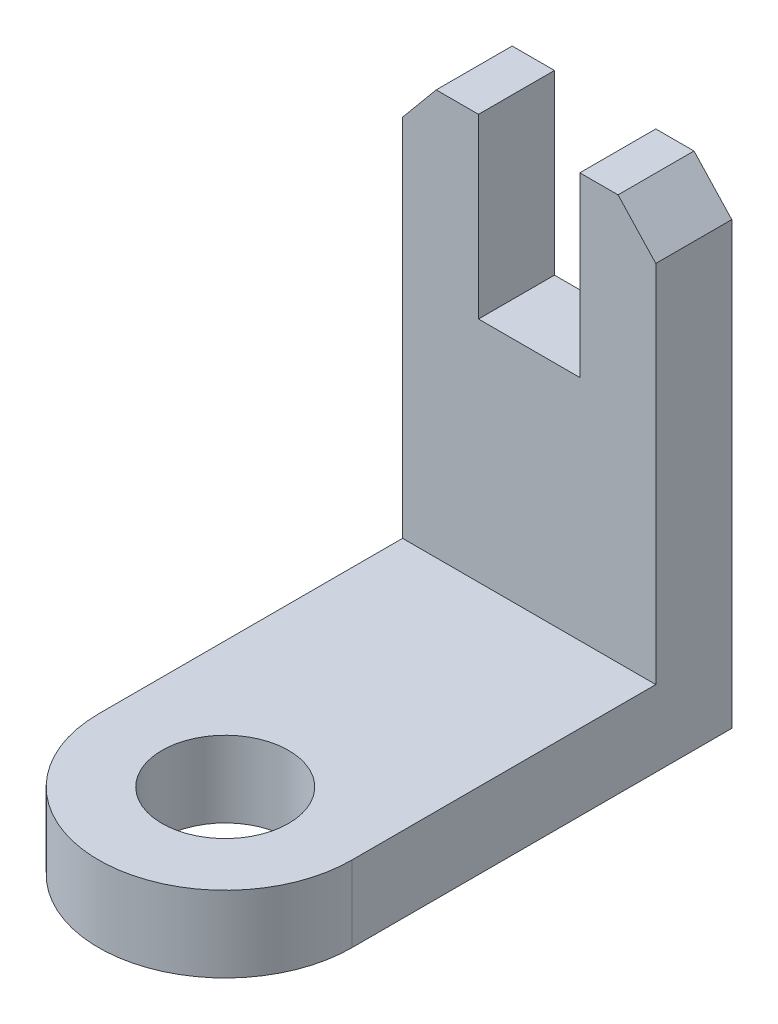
from build123d import *

# Parameters (mm, degrees)
SKETCH1_W           = 50
SKETCH1_H           = 80
EXTRUDE1_DEPTH      = 15
SKETCH2_W           = 50
SKETCH2_H           = 100
SKETCH2_R           = 12.5
EXTRUDE2_DEPTH      = 15
FILLET1_RADIUS      = 25
FILLET1_LENGTH      = 15
SKETCH_1_W          = 20
SKETCH_1_H          = 40.312785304
CUT_EXTRUDE_1_DEPTH = 127.984250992
CUT_EXTRUDE_2_DEPTH = 127.984250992


with BuildPart() as part:
    # Sketch1 → Extrude1 (new body)
    with BuildSketch(Plane.XY):
        with Locations((-25, 40)):
            Rectangle(SKETCH1_W, SKETCH1_H)
    extrude(amount=EXTRUDE1_DEPTH)

    # Sketch2 → Extrude2 (add)
    with BuildSketch(Plane.XZ):
        with Locations((-25, 50)):
            Rectangle(SKETCH2_W, SKETCH2_H)
        with Locations((-25, 75)):
            Circle(SKETCH2_R, mode=Mode.SUBTRACT)
    extrude(amount=EXTRUDE2_DEPTH)

    # Fillet1: full round fillet: the end face becomes a half cylinder, R = half its width
    fillet1_face = Plane((-25, -7.5, 100), x_dir=(0, 1, 0), z_dir=(0, 0, 1))  # on the end face: x along it, z out of the body
    fillet1_slab = fillet1_face.offset(-FILLET1_RADIUS / 2) * Box(FILLET1_LENGTH, 2 * FILLET1_RADIUS, FILLET1_RADIUS, mode=Mode.PRIVATE)  # the body's end, R deep
    fillet1_round = Plane((-25, -7.5, 75), x_dir=(0, 0, 1), z_dir=(0, 1, 0)) * Cylinder(FILLET1_RADIUS, FILLET1_LENGTH, mode=Mode.PRIVATE)  # its axis R under the face
    add(fillet1_slab - fillet1_round, mode=Mode.SUBTRACT)

    # Sketch 1 → Cut-Extrude 1 (cut, through all)
    with BuildSketch(Plane.XY.offset(15)):
        with Locations((-25, 65.156392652)):
            Rectangle(SKETCH_1_W, SKETCH_1_H)
    extrude(amount=-CUT_EXTRUDE_1_DEPTH, mode=Mode.SUBTRACT)

    # Sketch 2 → Cut-Extrude 2 (cut, through all)
    with BuildSketch(Plane.XY.offset(15)):
        Polygon((-50, 72), (-40.409054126, 83.549596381), (-52.942696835, 83.549596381), align=None)
        Polygon((0, 72), (-14.381962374, 87.431105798), (6.431567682, 87.431105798), align=None)
    extrude(amount=-CUT_EXTRUDE_2_DEPTH, mode=Mode.SUBTRACT)


solid = part.part
